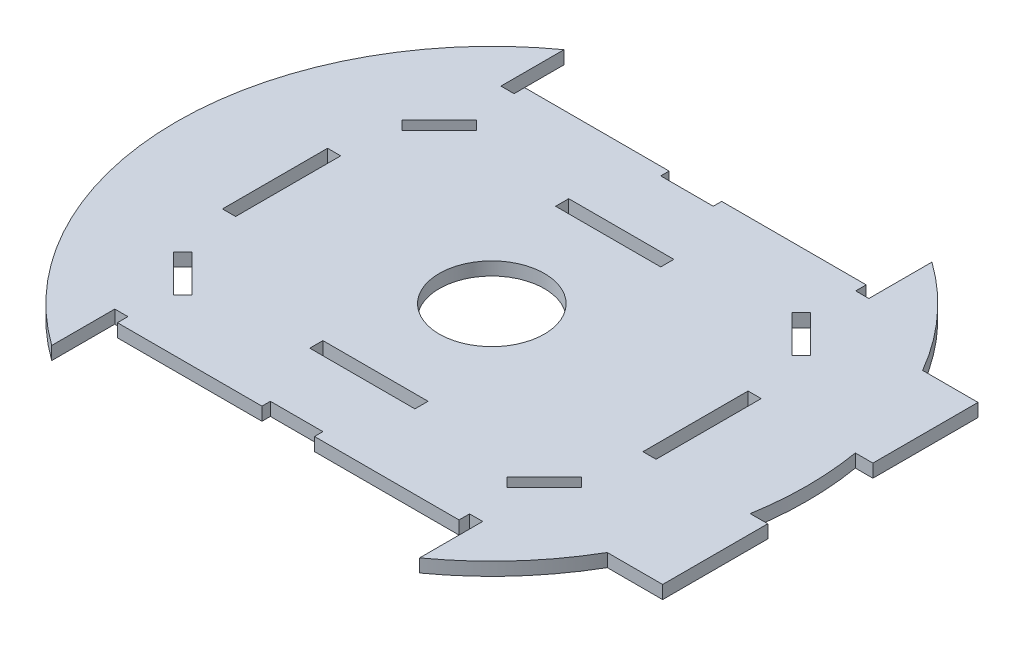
from build123d import *

# Parameters (mm, degrees)
SKETCH1_R           = 76.2
EXTRUDE1_DEPTH      = 1.5875
SKETCH7_W           = 3.175
SKETCH7_H           = 25.4
CUT_EXTRUDE2_DEPTH  = 108.809835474
CUT_EXTRUDE3_DEPTH  = 108.809835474
CUT_EXTRUDE4_DEPTH  = 99.219947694
SKETCH10_W          = 25.4
SKETCH10_H          = 3.175
CUT_EXTRUDE5_DEPTH  = 99.219947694
CUT_EXTRUDE6_DEPTH  = 99.219947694
SKETCH14_W          = 3.175
SKETCH14_H          = 2.54
CUT_EXTRUDE7_DEPTH  = 99.219947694
SKETCH17_R          = 12.7
CUT_EXTRUDE8_DEPTH  = 99.219947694
SKETCH18_W          = 13.383864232
SKETCH18_H          = 25.4
BOSS_EXTRUDE1_DEPTH = 3.175


with BuildPart() as part:
    # Sketch1 → Extrude1 (new, symmetric)
    with BuildSketch(Plane(origin=(0, 0, 0), x_dir=(1, 0, 0), z_dir=(0, 1, 0))):
        with Locations(Location((0, 0, 0), (0, 0, 270))):
            Circle(SKETCH1_R)
    extrude(amount=EXTRUDE1_DEPTH, both=True)

    # Sketch7 → Cut-Extrude2 (cut, through all)
    with BuildSketch(Plane(origin=(0, 1.5875, 0), x_dir=(1, 0, 0), z_dir=(0, 1, 0))):
        with Locations((50.8, 0)):
            Rectangle(SKETCH7_W, SKETCH7_H)
        with Locations((-50.8, 0)):
            Rectangle(SKETCH7_W, SKETCH7_H)
    extrude(amount=-CUT_EXTRUDE2_DEPTH, mode=Mode.SUBTRACT)

    # Sketch8 → Cut-Extrude3 (cut, through all)
    with BuildSketch(Plane(origin=(0, 1.5875, 0), x_dir=(-1, 0, 0), z_dir=(0, 1, 0))):
        Polygon((44.45, 61.89214409), (44.45, 49.19214409), (0, 49.19214409), (-44.45, 49.19214409), (-44.45, 61.89214409), (0, 99.99214409), align=None)
        Polygon((0, -49.19214409), (-44.45, -49.19214409), (-44.45, -61.89214409), (0, -99.99214409), (44.45, -61.89214409), (44.45, -49.19214409), align=None)
    extrude(amount=-CUT_EXTRUDE3_DEPTH, mode=Mode.SUBTRACT)

    # Sketch9 → Cut-Extrude4 (cut, through all)
    with BuildSketch(Plane(origin=(0, 1.5875, 0), x_dir=(1, 0, 0), z_dir=(0, 1, 0))):
        Polygon((-6.35, -49.19214409), (-6.35, -47.16014409), (0, -47.16014409), (6.35, -47.16014409), (6.35, -49.19214409), align=None)
        Polygon((6.35, 49.19214409), (-6.35, 49.19214409), (-6.35, 47.16014409), (0, 47.16014409), (6.35, 47.16014409), align=None)
    extrude(amount=-CUT_EXTRUDE4_DEPTH, mode=Mode.SUBTRACT)

    # Sketch10 → Cut-Extrude5 (cut, through all)
    with BuildSketch(Plane(origin=(0, 1.5875, 0), x_dir=(1, 0, 0), z_dir=(0, 1, 0))):
        with Locations((0, -29.69764409)):
            Rectangle(SKETCH10_W, SKETCH10_H)
        with Locations((0, 29.69764409)):
            Rectangle(SKETCH10_W, SKETCH10_H)
    extrude(amount=-CUT_EXTRUDE5_DEPTH, mode=Mode.SUBTRACT)

    # Sketch12 → Cut-Extrude6 (cut, through all)
    with BuildSketch(Plane(origin=(0, 1.5875, 0), x_dir=(1, 0, 0), z_dir=(0, 1, 0))):
        Polygon((-40.34506403, 36.625320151), (-49.325320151, 27.64506403), (-47.080256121, 25.4), (-38.1, 34.380256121), align=None)
        Polygon((38.1, 34.380256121), (47.080256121, 25.4), (49.325320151, 27.64506403), (40.34506403, 36.625320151), align=None)
        Polygon((40.34506403, -36.625320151), (49.325320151, -27.64506403), (47.080256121, -25.4), (38.1, -34.380256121), align=None)
        Polygon((-38.1, -34.380256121), (-47.080256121, -25.4), (-49.325320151, -27.64506403), (-40.34506403, -36.625320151), align=None)
    extrude(amount=-CUT_EXTRUDE6_DEPTH, mode=Mode.SUBTRACT)

    # Sketch14 → Cut-Extrude7 (cut, through all)
    with BuildSketch(Plane(origin=(0, 1.5875, 0), x_dir=(1, 0, 0), z_dir=(0, 1, 0))):
        with Locations((-42.8625, -47.92214409)):
            Rectangle(SKETCH14_W, SKETCH14_H)
        with Locations((42.8625, -47.92214409)):
            Rectangle(SKETCH14_W, SKETCH14_H)
        with Locations((42.8625, 47.92214409)):
            Rectangle(SKETCH14_W, SKETCH14_H)
        with Locations((-42.8625, 47.92214409)):
            Rectangle(SKETCH14_W, SKETCH14_H)
    extrude(amount=-CUT_EXTRUDE7_DEPTH, mode=Mode.SUBTRACT)

    # Sketch17 → Cut-Extrude8 (cut, through all)
    with BuildSketch(Plane(origin=(0, 1.5875, 0), x_dir=(1, 0, 0), z_dir=(0, 1, 0))):
        with Locations(Location((0, 0, 0), (0, 0, 270))):
            Circle(SKETCH17_R)
    extrude(amount=-CUT_EXTRUDE8_DEPTH, mode=Mode.SUBTRACT)

    # Sketch18 → Boss-Extrude1 (add, through all)
    with BuildSketch(Plane(origin=(0, 1.5875, 0), x_dir=(1, 0, 0), z_dir=(0, 1, 0))):
        with Locations((72.683067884, -25.4)):
            Rectangle(SKETCH18_W, SKETCH18_H)
        with Locations((72.683067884, 25.4)):
            Rectangle(SKETCH18_W, SKETCH18_H)
    extrude(amount=-BOSS_EXTRUDE1_DEPTH)


solid = part.part
